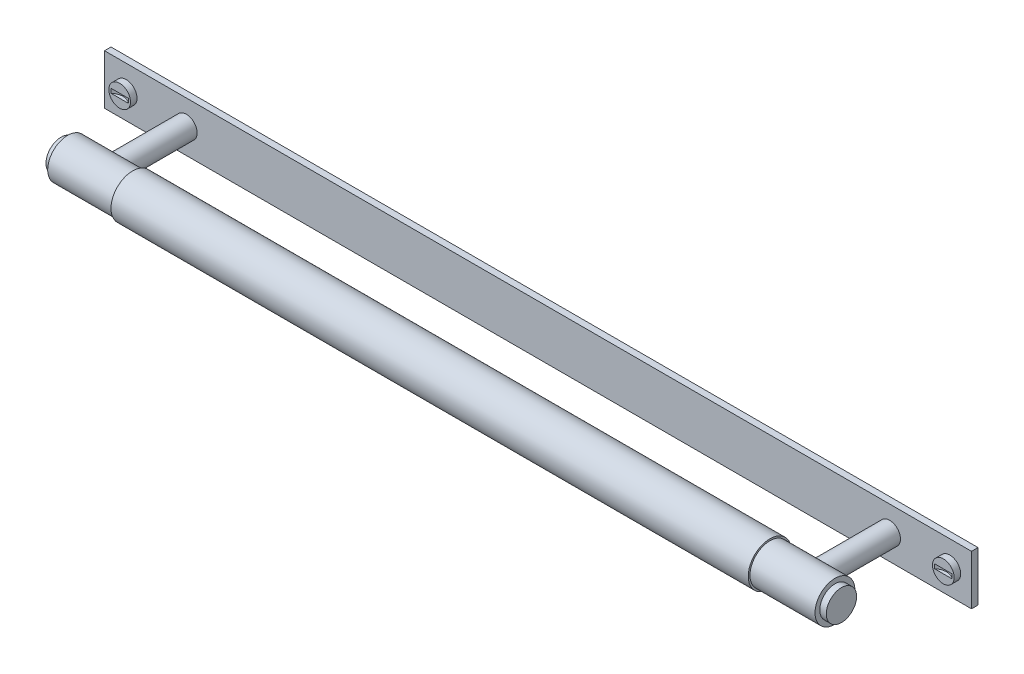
from build123d import *

# Parameters (mm, degrees)
SKETCH1_R           = 10
BOSS_EXTRUDE1_DEPTH = 147
SKETCH2_R           = 9.2
BOSS_EXTRUDE3_DEPTH = 30
SKETCH3_R           = 7
BOSS_EXTRUDE4_DEPTH = 3
SKETCH4_R           = 5
BOSS_EXTRUDE5_DEPTH = 40
SKETCH9_W           = 3
SKETCH9_H           = 23
BOSS_EXTRUDE8_DEPTH = 200
SKETCH10_R          = 5
BOSS_EXTRUDE9_DEPTH = 3
CUT_EXTRUDE1_DEPTH  = 1


with BuildPart() as part:
    # Sketch1 → Boss-Extrude1 (new body)
    with BuildSketch(Plane(origin=(0, 0, 0), x_dir=(0, 0, -1), z_dir=(1, 0, 0))):
        Circle(SKETCH1_R)
    boss_extrude1 = extrude(amount=BOSS_EXTRUDE1_DEPTH)

    # Sketch2 → Boss-Extrude3 (add)
    with BuildSketch(Plane(origin=(147, 0, 0), x_dir=(0, 0, -1), z_dir=(1, 0, 0))):
        Circle(SKETCH2_R)
    boss_extrude3 = extrude(amount=BOSS_EXTRUDE3_DEPTH)

    # Sketch3 → Boss-Extrude4 (add)
    with BuildSketch(Plane(origin=(177, 0, 0), x_dir=(0, 0, -1), z_dir=(1, 0, 0))):
        Circle(SKETCH3_R)
    boss_extrude4 = extrude(amount=BOSS_EXTRUDE4_DEPTH)

    # Mirror1: Boss-Extrude1, Boss-Extrude3, Boss-Extrude4 across plane
    add(boss_extrude1.mirror(Plane(origin=(0, 0, 0), x_dir=(0, 0, 1), z_dir=(1, 0, 0))))
    add(boss_extrude3.mirror(Plane(origin=(0, 0, 0), x_dir=(0, 0, 1), z_dir=(1, 0, 0))))
    add(boss_extrude4.mirror(Plane(origin=(0, 0, 0), x_dir=(0, 0, 1), z_dir=(1, 0, 0))))

    # Sketch4 → Boss-Extrude5 (add)
    with BuildSketch(Plane.XY):
        with Locations((-162.25, 0)):
            Circle(SKETCH4_R)
    boss_extrude5 = extrude(amount=-BOSS_EXTRUDE5_DEPTH)

    # Mirror2: Boss-Extrude5 across plane
    add(boss_extrude5.mirror(Plane(origin=(0, 0, 0), x_dir=(0, 0, 1), z_dir=(1, 0, 0))))

    # Sketch9 → Boss-Extrude8 (add, symmetric)
    with BuildSketch(Plane(origin=(0, 0, 0), x_dir=(0, 0, -1), z_dir=(1, 0, 0))):
        with Locations((41.5, 0)):
            Rectangle(SKETCH9_W, SKETCH9_H)
    extrude(amount=BOSS_EXTRUDE8_DEPTH, both=True)

    # Sketch10 → Boss-Extrude9 (add)
    with BuildSketch(Plane.XY.offset(-40)):
        with Locations(Location((190, 0, 0), (0, 0, 180))):
            Circle(SKETCH10_R)
    boss_extrude9 = extrude(amount=BOSS_EXTRUDE9_DEPTH)

    # Sketch11 → Cut-Extrude1 (cut, symmetric)
    with BuildSketch(Plane(origin=(0, 0, 0), x_dir=(1, 0, 0), z_dir=(0, 1, 0))):
        with BuildLine():
            Line((186, 37), (186, 34.634603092))
            Line((186, 34.634603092), (194, 34.634603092))
            Line((194, 34.634603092), (194, 37))
            ThreePointArc((194, 37), (190, 38.527864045), (186, 37))
        make_face()
    cut_extrude1 = extrude(amount=CUT_EXTRUDE1_DEPTH, both=True, mode=Mode.SUBTRACT)

    # Mirror3: Boss-Extrude9, Cut-Extrude1 across plane
    add(boss_extrude9.mirror(Plane(origin=(0, 0, 0), x_dir=(0, 0, 1), z_dir=(1, 0, 0))))
    add(cut_extrude1.mirror(Plane(origin=(0, 0, 0), x_dir=(0, 0, 1), z_dir=(1, 0, 0))), mode=Mode.SUBTRACT)


solid = part.part
